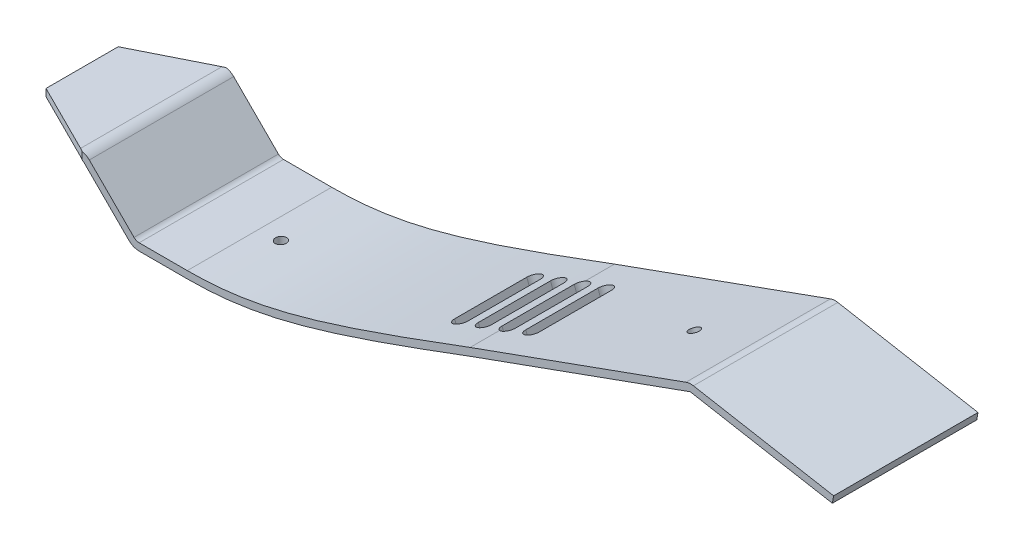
from build123d import *

# Parameters (mm, degrees)
EXTRUSION1_DEPTH        = 40
ENL_V_MAT_EXTRU_1_DEPTH = 138.659432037
ESQUISSE3_R             = 1.5
ENL_V_MAT_EXTRU_2_DEPTH = 20
ESQUISSE4_R             = 1.5
ENL_V_MAT_EXTRU_3_DEPTH = 40
ENL_V_MAT_EXTRU_4_DEPTH = 10


with BuildPart() as part:
    # Esquisse1 → Extrusion1 (new body)
    with BuildSketch(Plane.XY):
        with BuildLine():
            Line((99.235181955, 25.387613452), (59.864814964, 32.456856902))
            Line((59.864814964, 32.456856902), (-0.428698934, 10.72538019))
            add(Edge.make_bspline(
                [(-79.481235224, -10.141246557), (-59.220218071, -10.152604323), (-40.919101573, -4.415070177), (-0.428698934, 10.72538019)],
                knots=[0, 0, 0, 0, 1, 1, 1, 1], degree=3))
            Line((-79.481235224, -10.141246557), (-92.824380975, -10.141246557))
            ThreePointArc((-92.824380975, -10.141246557), (-94.355114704, -9.836764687), (-95.6528081, -8.969673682))
            Line((-95.6528081, -8.969673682), (-108.037584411, 3.415102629))
            ThreePointArc((-108.037584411, 3.415102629), (-108.686431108, 3.848648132), (-109.451797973, 4.000889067))
            Line((-109.451797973, 4.000889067), (-128.623370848, 4.000889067))
            Line((-128.623370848, 4.000889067), (-128.623370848, 6.000889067))
            Line((-128.623370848, 6.000889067), (-109.451797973, 6.000889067))
            ThreePointArc((-109.451797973, 6.000889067), (-107.921064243, 5.696407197), (-106.623370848, 4.829316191))
            Line((-106.623370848, 4.829316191), (-94.238594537, -7.55546012))
            ThreePointArc((-94.238594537, -7.55546012), (-93.58974784, -7.989005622), (-92.824380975, -8.141246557))
            Line((-92.824380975, -8.141246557), (-79.480674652, -8.141246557))
            add(Edge.make_bspline(
                [(-79.480674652, -8.141246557), (-74.496425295, -8.14404059), (-67.257637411, -7.621329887), (-56.778199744, -5.692178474), (-48.2282936, -3.57878746), (-40.288000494, -1.222621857), (-33.307701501, 1.041810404), (-27.723671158, 2.935253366), (-21.756112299, 5.029163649), (-16.434763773, 6.945464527), (-11.950915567, 8.58407574), (-8.471199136, 9.866130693), (-5.467368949, 10.980452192), (-3.00661888, 11.89720339), (-1.744862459, 12.36847955), (-1.118041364, 12.602864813)],
                knots=[-9.223e-06, -9.223e-06, -9.223e-06, -9.223e-06, 0.250016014, 0.375028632, 0.50004125, 0.625053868, 0.687560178, 0.750066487, 0.812572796, 0.875079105, 0.906332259, 0.937585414, 0.968838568, 0.984465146, 1.000091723, 1.000091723, 1.000091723, 1.000091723], degree=3))
            Line((-1.118041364, 12.602864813), (58.682511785, 34.156664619))
            ThreePointArc((58.682511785, 34.156664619), (59.702672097, 34.37947956), (60.745740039, 34.330665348))
            Line((60.745740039, 34.330665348), (99.588644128, 27.356131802))
            Line((99.588644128, 27.356131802), (99.235181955, 25.387613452))
        make_face()
    extrude(amount=EXTRUSION1_DEPTH)

    # Esquisse2 → Enl_v. mat.-Extru.1 (cut, through all)
    with BuildSketch(Plane(origin=(0, 6.000889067, 0), x_dir=(-1, 0, 0), z_dir=(0, 1, 0))):
        Polygon((128.623370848, 10), (108.623370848, 0), (108.623370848, -4.738879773), (133.149537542, -4.738879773), (133.149537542, 10), align=None)
        Polygon((133.149537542, 44.738879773), (133.149537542, 30), (128.623370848, 30), (108.623370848, 40), (108.623370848, 44.738879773), align=None)
    extrude(amount=-ENL_V_MAT_EXTRU_1_DEPTH, mode=Mode.SUBTRACT)

    # Esquisse3 → Enl_v. mat.-Extru.2 (cut, symmetric)
    with BuildSketch(Plane(origin=(0, -8.141246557, 0), x_dir=(-1, 0, 0), z_dir=(0, 1, 0))):
        with Locations(Location((73.542953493, 20, 0), (0, 0, 90))):
            Circle(ESQUISSE3_R)
    extrude(amount=ENL_V_MAT_EXTRU_2_DEPTH, both=True, mode=Mode.SUBTRACT)

    # Esquisse4 → Enl_v. mat.-Extru.3 (cut)
    with BuildSketch(Plane(origin=(-4.148716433, 11.510524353, 0), x_dir=(-0.9407589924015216, -0.3390759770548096, 0), z_dir=(-0.3390759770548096, 0.9407589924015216, 0))):
        with Locations((-47.984125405, 20)):
            Circle(ESQUISSE4_R)
    extrude(amount=-ENL_V_MAT_EXTRU_3_DEPTH, mode=Mode.SUBTRACT)

    # Esquisse5 → Enl_v. mat.-Extru.4 (cut, symmetric)
    with BuildSketch(Plane(origin=(-4.148716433, 11.510524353, 0), x_dir=(-0.9407589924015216, -0.3390759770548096, 0), z_dir=(-0.3390759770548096, 0.9407589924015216, 0))):
        with BuildLine():
            Line((-5.984125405, 30), (-5.984125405, 10))
            ThreePointArc((-5.984125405, 10), (-3.984125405, 8), (-1.984125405, 10))
            Line((-1.984125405, 10), (-1.984125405, 30))
            ThreePointArc((-1.984125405, 30), (-3.984125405, 32), (-5.984125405, 30))
        make_face()
        with BuildLine():
            Line((-12.984125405, 30), (-12.984125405, 10))
            ThreePointArc((-12.984125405, 10), (-10.984125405, 8), (-8.984125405, 10))
            Line((-8.984125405, 10), (-8.984125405, 30))
            ThreePointArc((-8.984125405, 30), (-10.984125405, 32), (-12.984125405, 30))
        make_face()
        with BuildLine():
            Line((1.015874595, 30), (1.015874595, 10))
            ThreePointArc((1.015874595, 10), (3.015874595, 8), (5.015874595, 10))
            Line((5.015874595, 10), (5.015874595, 30))
            ThreePointArc((5.015874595, 30), (3.015874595, 32), (1.015874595, 30))
        make_face()
        with BuildLine():
            Line((8.015874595, 30), (8.015874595, 10))
            ThreePointArc((8.015874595, 10), (10.015874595, 8), (12.015874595, 10))
            Line((12.015874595, 10), (12.015874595, 30))
            ThreePointArc((12.015874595, 30), (10.015874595, 32), (8.015874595, 30))
        make_face()
    extrude(amount=ENL_V_MAT_EXTRU_4_DEPTH, both=True, mode=Mode.SUBTRACT)


solid = part.part
